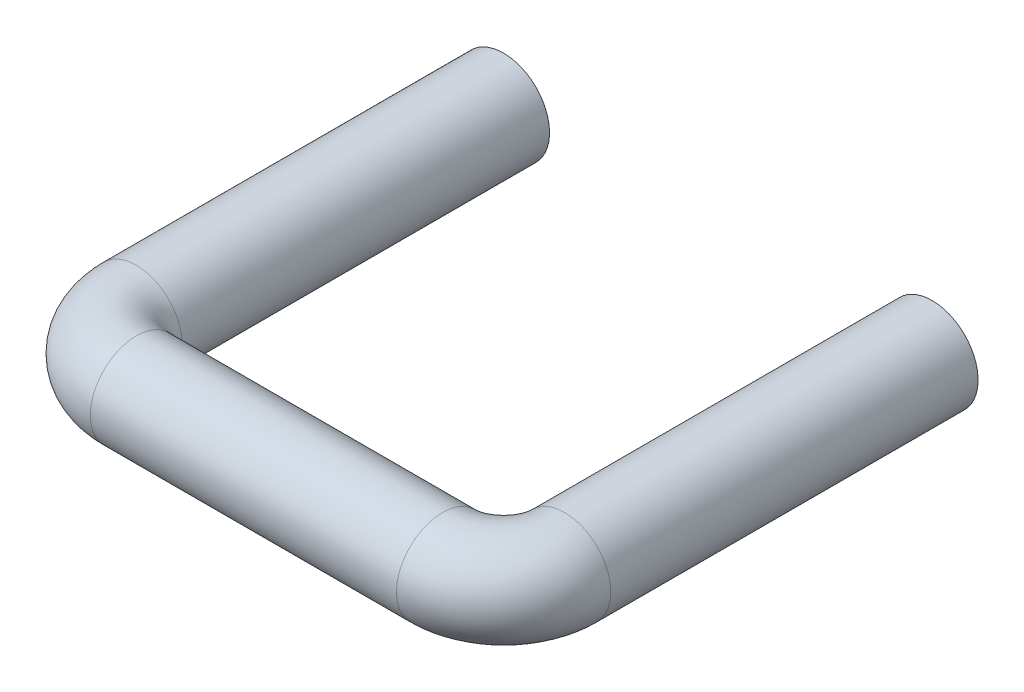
from build123d import *

# Parameters (mm, degrees)
SKETCH2_R = 7.5


with BuildPart() as part:
    # Sweep1: sweep along a path in Sketch1
    with BuildLine(Plane(origin=(0, 0, 0), x_dir=(1, 0, 0), z_dir=(0, 1, 0))) as sweep1_path:
        Line((0, 0), (0, -60))
        ThreePointArc((0, -60), (2.928932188, -67.071067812), (10, -70))
        Line((10, -70), (60, -70))
        ThreePointArc((60, -70), (67.071067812, -67.071067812), (70, -60))
        Line((70, -60), (70, 0))
    # Sketch2 → Sweep1 (sweep)
    with BuildSketch(Plane.XY):
        Circle(SKETCH2_R)
    sweep(path=sweep1_path.line)


solid = part.part
